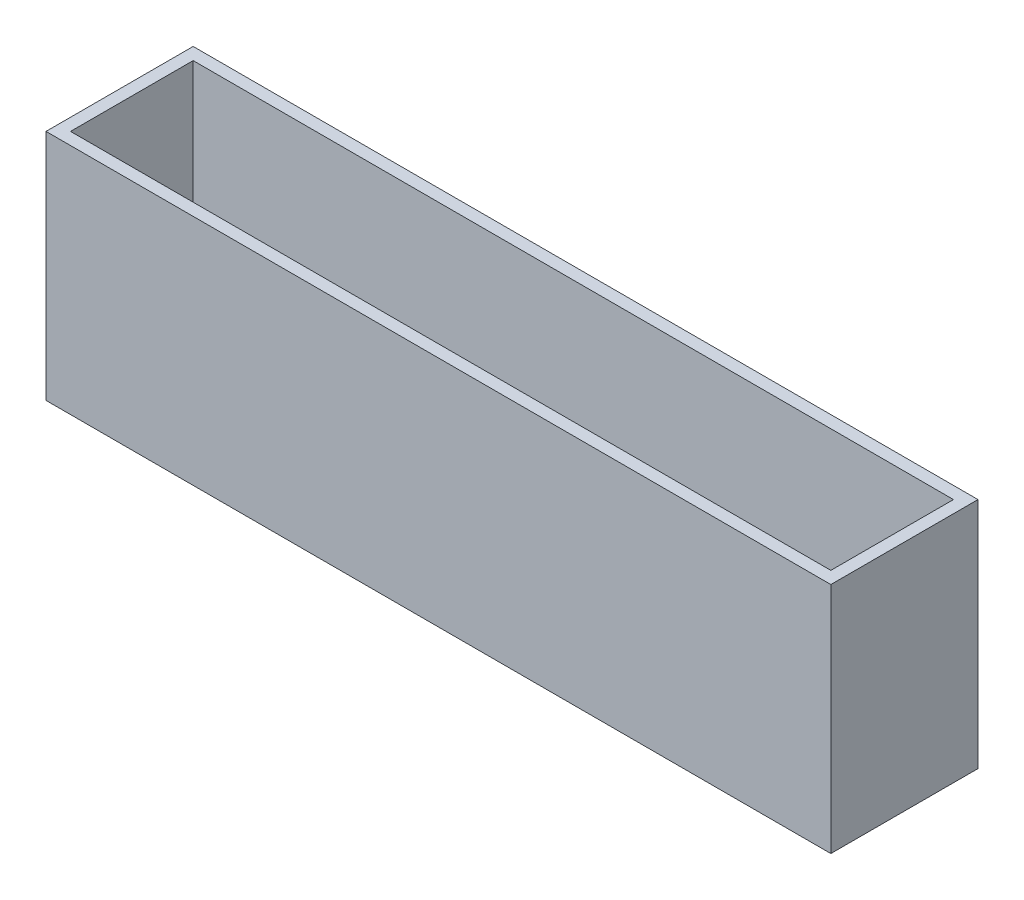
ISO-10303-21;
HEADER;
FILE_DESCRIPTION(('STEP AP214'),'2;1');
FILE_NAME('part.step','',(''),(''),'','','');
FILE_SCHEMA(('AUTOMOTIVE_DESIGN { 1 0 10303 214 1 1 1 1 }'));
ENDSEC;
DATA;
#1=APPLICATION_CONTEXT('core data for automotive mechanical design processes');
#2=APPLICATION_PROTOCOL_DEFINITION('international standard','automotive_design',2000,#1);
#3=PRODUCT_CONTEXT('',#1,'mechanical');
#4=PRODUCT('Part','Part','',(#3));
#5=PRODUCT_RELATED_PRODUCT_CATEGORY('part','',(#4));
#6=PRODUCT_DEFINITION_FORMATION('','',#4);
#7=PRODUCT_DEFINITION_CONTEXT('part definition',#1,'design');
#8=PRODUCT_DEFINITION('design','',#6,#7);
#9=PRODUCT_DEFINITION_SHAPE('','',#8);
#10=(LENGTH_UNIT() NAMED_UNIT(*) SI_UNIT(.MILLI.,.METRE.));
#11=(NAMED_UNIT(*) PLANE_ANGLE_UNIT() SI_UNIT($,.RADIAN.));
#12=(NAMED_UNIT(*) SI_UNIT($,.STERADIAN.) SOLID_ANGLE_UNIT());
#13=UNCERTAINTY_MEASURE_WITH_UNIT(LENGTH_MEASURE(1.E-05),#10,'distance_accuracy_value','');
#14=(GEOMETRIC_REPRESENTATION_CONTEXT(3) GLOBAL_UNCERTAINTY_ASSIGNED_CONTEXT((#13)) GLOBAL_UNIT_ASSIGNED_CONTEXT((#10,
#11,#12)) REPRESENTATION_CONTEXT('',''));
#15=CARTESIAN_POINT('',(0.,0.,0.));
#16=DIRECTION('',(0.,0.,1.));
#17=DIRECTION('',(1.,0.,0.));
#18=AXIS2_PLACEMENT_3D('',#15,#16,#17);
#19=CARTESIAN_POINT('',(-321.754973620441,12.7,0.));
#20=DIRECTION('',(0.,1.,0.));
#21=DIRECTION('',(0.,0.,1.));
#22=AXIS2_PLACEMENT_3D('',#19,#20,#21);
#23=PLANE('',#22);
#24=DIRECTION('',(-1.,0.,0.));
#25=VECTOR('',#24,1.);
#26=CARTESIAN_POINT('',(-321.754973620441,12.7,4.7625));
#27=LINE('',#26,#25);
#28=CARTESIAN_POINT('',(152.4,12.7,4.7625));
#29=VERTEX_POINT('',#28);
#30=CARTESIAN_POINT('',(-152.4,12.7,4.7625));
#31=VERTEX_POINT('',#30);
#32=EDGE_CURVE('E252',#29,#31,#27,.T.);
#33=ORIENTED_EDGE('',*,*,#32,.T.);
#34=CARTESIAN_POINT('',(-152.4,12.7,0.));
#35=DIRECTION('',(0.,1.,0.));
#36=DIRECTION('',(0.,0.,1.));
#37=AXIS2_PLACEMENT_3D('',#34,#35,#36);
#38=CIRCLE('',#37,4.76250000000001);
#39=CARTESIAN_POINT('',(-152.4,12.7,-4.76250000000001));
#40=VERTEX_POINT('',#39);
#41=EDGE_CURVE('E249',#40,#31,#38,.T.);
#42=ORIENTED_EDGE('',*,*,#41,.F.);
#43=DIRECTION('',(1.,0.,0.));
#44=VECTOR('',#43,1.);
#45=CARTESIAN_POINT('',(-321.754973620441,12.7,-4.76249999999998));
#46=LINE('',#45,#44);
#47=CARTESIAN_POINT('',(152.4,12.7,-4.76250000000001));
#48=VERTEX_POINT('',#47);
#49=EDGE_CURVE('E247',#40,#48,#46,.T.);
#50=ORIENTED_EDGE('',*,*,#49,.T.);
#51=CARTESIAN_POINT('',(152.4,12.7,0.));
#52=DIRECTION('',(0.,1.,0.));
#53=DIRECTION('',(0.,0.,1.));
#54=AXIS2_PLACEMENT_3D('',#51,#52,#53);
#55=CIRCLE('',#54,4.76250000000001);
#56=EDGE_CURVE('E237',#29,#48,#55,.T.);
#57=ORIENTED_EDGE('',*,*,#56,.F.);
#58=EDGE_LOOP('',(#33,#42,#50,#57));
#59=FACE_BOUND('',#58,.T.);
#60=DIRECTION('',(1.,0.,0.));
#61=VECTOR('',#60,1.);
#62=CARTESIAN_POINT('',(203.2,12.7,-31.75));
#63=LINE('',#62,#61);
#64=CARTESIAN_POINT('',(-196.85,12.7,-31.75));
#65=VERTEX_POINT('',#64);
#66=CARTESIAN_POINT('',(196.85,12.7,-31.75));
#67=VERTEX_POINT('',#66);
#68=EDGE_CURVE('E210',#65,#67,#63,.T.);
#69=ORIENTED_EDGE('',*,*,#68,.F.);
#70=DIRECTION('',(0.,0.,-1.));
#71=VECTOR('',#70,1.);
#72=CARTESIAN_POINT('',(-196.85,12.7,31.75));
#73=LINE('',#72,#71);
#74=CARTESIAN_POINT('',(-196.85,12.7,31.75));
#75=VERTEX_POINT('',#74);
#76=EDGE_CURVE('E190',#75,#65,#73,.T.);
#77=ORIENTED_EDGE('',*,*,#76,.F.);
#78=DIRECTION('',(1.,0.,0.));
#79=VECTOR('',#78,1.);
#80=CARTESIAN_POINT('',(203.2,12.7,31.75));
#81=LINE('',#80,#79);
#82=CARTESIAN_POINT('',(196.85,12.7,31.75));
#83=VERTEX_POINT('',#82);
#84=EDGE_CURVE('E218',#75,#83,#81,.T.);
#85=ORIENTED_EDGE('',*,*,#84,.T.);
#86=DIRECTION('',(0.,0.,-1.));
#87=VECTOR('',#86,1.);
#88=CARTESIAN_POINT('',(196.85,12.7,31.75));
#89=LINE('',#88,#87);
#90=EDGE_CURVE('E204',#83,#67,#89,.T.);
#91=ORIENTED_EDGE('',*,*,#90,.T.);
#92=EDGE_LOOP('',(#69,#77,#85,#91));
#93=FACE_BOUND('',#92,.T.);
#94=ADVANCED_FACE('F29',(#59,#93),#23,.T.);
#95=CARTESIAN_POINT('',(203.2,12.7,31.75));
#96=DIRECTION('',(0.,0.,-1.));
#97=DIRECTION('',(-1.,0.,0.));
#98=AXIS2_PLACEMENT_3D('',#95,#96,#97);
#99=PLANE('',#98);
#100=ORIENTED_EDGE('',*,*,#84,.F.);
#101=DIRECTION('',(0.,-1.,0.));
#102=VECTOR('',#101,1.);
#103=CARTESIAN_POINT('',(-196.85,120.65,31.75));
#104=LINE('',#103,#102);
#105=CARTESIAN_POINT('',(-196.85,120.65,31.75));
#106=VERTEX_POINT('',#105);
#107=EDGE_CURVE('E192',#106,#75,#104,.T.);
#108=ORIENTED_EDGE('',*,*,#107,.F.);
#109=DIRECTION('',(-1.,0.,0.));
#110=VECTOR('',#109,1.);
#111=CARTESIAN_POINT('',(203.2,120.65,31.75));
#112=LINE('',#111,#110);
#113=CARTESIAN_POINT('',(196.85,120.65,31.75));
#114=VERTEX_POINT('',#113);
#115=EDGE_CURVE('E221',#114,#106,#112,.T.);
#116=ORIENTED_EDGE('',*,*,#115,.F.);
#117=DIRECTION('',(0.,-1.,0.));
#118=VECTOR('',#117,1.);
#119=CARTESIAN_POINT('',(196.85,120.65,31.75));
#120=LINE('',#119,#118);
#121=EDGE_CURVE('E201',#114,#83,#120,.T.);
#122=ORIENTED_EDGE('',*,*,#121,.T.);
#123=EDGE_LOOP('',(#100,#108,#116,#122));
#124=FACE_BOUND('',#123,.T.);
#125=ADVANCED_FACE('F302',(#124),#99,.T.);
#126=CARTESIAN_POINT('',(203.2,12.7,-31.75));
#127=DIRECTION('',(0.,0.,1.));
#128=DIRECTION('',(-1.,0.,0.));
#129=AXIS2_PLACEMENT_3D('',#126,#127,#128);
#130=PLANE('',#129);
#131=DIRECTION('',(-1.,0.,0.));
#132=VECTOR('',#131,1.);
#133=CARTESIAN_POINT('',(203.2,120.65,-31.75));
#134=LINE('',#133,#132);
#135=CARTESIAN_POINT('',(196.85,120.65,-31.75));
#136=VERTEX_POINT('',#135);
#137=CARTESIAN_POINT('',(-196.85,120.65,-31.75));
#138=VERTEX_POINT('',#137);
#139=EDGE_CURVE('E212',#136,#138,#134,.T.);
#140=ORIENTED_EDGE('',*,*,#139,.T.);
#141=DIRECTION('',(0.,1.,0.));
#142=VECTOR('',#141,1.);
#143=CARTESIAN_POINT('',(-196.85,12.7,-31.75));
#144=LINE('',#143,#142);
#145=EDGE_CURVE('E187',#65,#138,#144,.T.);
#146=ORIENTED_EDGE('',*,*,#145,.F.);
#147=ORIENTED_EDGE('',*,*,#68,.T.);
#148=DIRECTION('',(0.,1.,0.));
#149=VECTOR('',#148,1.);
#150=CARTESIAN_POINT('',(196.85,12.7,-31.75));
#151=LINE('',#150,#149);
#152=EDGE_CURVE('E196',#67,#136,#151,.T.);
#153=ORIENTED_EDGE('',*,*,#152,.T.);
#154=EDGE_LOOP('',(#140,#146,#147,#153));
#155=FACE_BOUND('',#154,.T.);
#156=ADVANCED_FACE('F308',(#155),#130,.T.);
#157=CARTESIAN_POINT('',(-203.2,12.7,0.));
#158=DIRECTION('',(1.,0.,0.));
#159=DIRECTION('',(0.,0.,-1.));
#160=AXIS2_PLACEMENT_3D('',#157,#158,#159);
#161=PLANE('',#160);
#162=DIRECTION('',(0.,0.,1.));
#163=VECTOR('',#162,1.);
#164=CARTESIAN_POINT('',(-203.2,0.,0.));
#165=LINE('',#164,#163);
#166=CARTESIAN_POINT('',(-203.2,0.,-38.1));
#167=VERTEX_POINT('',#166);
#168=CARTESIAN_POINT('',(-203.2,0.,38.1));
#169=VERTEX_POINT('',#168);
#170=EDGE_CURVE('E262',#167,#169,#165,.T.);
#171=ORIENTED_EDGE('',*,*,#170,.T.);
#172=DIRECTION('',(0.,-1.,0.));
#173=VECTOR('',#172,1.);
#174=CARTESIAN_POINT('',(-203.2,12.7,38.1));
#175=LINE('',#174,#173);
#176=CARTESIAN_POINT('',(-203.2,120.65,38.1));
#177=VERTEX_POINT('',#176);
#178=EDGE_CURVE('E37',#177,#169,#175,.T.);
#179=ORIENTED_EDGE('',*,*,#178,.F.);
#180=DIRECTION('',(0.,0.,1.));
#181=VECTOR('',#180,1.);
#182=CARTESIAN_POINT('',(-203.2,120.65,31.75));
#183=LINE('',#182,#181);
#184=CARTESIAN_POINT('',(-203.2,120.65,-38.1));
#185=VERTEX_POINT('',#184);
#186=EDGE_CURVE('E265',#185,#177,#183,.T.);
#187=ORIENTED_EDGE('',*,*,#186,.F.);
#188=DIRECTION('',(0.,-1.,0.));
#189=VECTOR('',#188,1.);
#190=CARTESIAN_POINT('',(-203.2,12.7,-38.1));
#191=LINE('',#190,#189);
#192=EDGE_CURVE('E227',#185,#167,#191,.T.);
#193=ORIENTED_EDGE('',*,*,#192,.T.);
#194=EDGE_LOOP('',(#171,#179,#187,#193));
#195=FACE_BOUND('',#194,.T.);
#196=ADVANCED_FACE('F287',(#195),#161,.F.);
#197=CARTESIAN_POINT('',(-321.754973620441,12.7,38.1));
#198=DIRECTION('',(0.,0.,1.));
#199=DIRECTION('',(1.,0.,0.));
#200=AXIS2_PLACEMENT_3D('',#197,#198,#199);
#201=PLANE('',#200);
#202=DIRECTION('',(-1.,0.,0.));
#203=VECTOR('',#202,1.);
#204=CARTESIAN_POINT('',(-321.754973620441,0.,38.1));
#205=LINE('',#204,#203);
#206=CARTESIAN_POINT('',(203.2,0.,38.0999999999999));
#207=VERTEX_POINT('',#206);
#208=EDGE_CURVE('E259',#207,#169,#205,.T.);
#209=ORIENTED_EDGE('',*,*,#208,.F.);
#210=DIRECTION('',(0.,-1.,0.));
#211=VECTOR('',#210,1.);
#212=CARTESIAN_POINT('',(203.2,12.7,38.0999999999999));
#213=LINE('',#212,#211);
#214=CARTESIAN_POINT('',(203.2,120.65,38.1));
#215=VERTEX_POINT('',#214);
#216=EDGE_CURVE('E239',#215,#207,#213,.T.);
#217=ORIENTED_EDGE('',*,*,#216,.F.);
#218=DIRECTION('',(-1.,0.,0.));
#219=VECTOR('',#218,1.);
#220=CARTESIAN_POINT('',(203.2,120.65,38.1));
#221=LINE('',#220,#219);
#222=EDGE_CURVE('E215',#215,#177,#221,.T.);
#223=ORIENTED_EDGE('',*,*,#222,.T.);
#224=ORIENTED_EDGE('',*,*,#178,.T.);
#225=EDGE_LOOP('',(#209,#217,#223,#224));
#226=FACE_BOUND('',#225,.T.);
#227=ADVANCED_FACE('F278',(#226),#201,.T.);
#228=CARTESIAN_POINT('',(203.2,12.7,0.));
#229=DIRECTION('',(1.,0.,0.));
#230=DIRECTION('',(0.,0.,-1.));
#231=AXIS2_PLACEMENT_3D('',#228,#229,#230);
#232=PLANE('',#231);
#233=DIRECTION('',(0.,-1.,0.));
#234=VECTOR('',#233,1.);
#235=CARTESIAN_POINT('',(203.2,12.7,-38.1000000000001));
#236=LINE('',#235,#234);
#237=CARTESIAN_POINT('',(203.2,120.65,-38.1));
#238=VERTEX_POINT('',#237);
#239=CARTESIAN_POINT('',(203.2,0.,-38.1000000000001));
#240=VERTEX_POINT('',#239);
#241=EDGE_CURVE('E241',#238,#240,#236,.T.);
#242=ORIENTED_EDGE('',*,*,#241,.F.);
#243=DIRECTION('',(0.,0.,1.));
#244=VECTOR('',#243,1.);
#245=CARTESIAN_POINT('',(203.2,120.65,31.75));
#246=LINE('',#245,#244);
#247=EDGE_CURVE('E266',#238,#215,#246,.T.);
#248=ORIENTED_EDGE('',*,*,#247,.T.);
#249=ORIENTED_EDGE('',*,*,#216,.T.);
#250=DIRECTION('',(0.,0.,1.));
#251=VECTOR('',#250,1.);
#252=CARTESIAN_POINT('',(203.2,0.,0.));
#253=LINE('',#252,#251);
#254=EDGE_CURVE('E256',#240,#207,#253,.T.);
#255=ORIENTED_EDGE('',*,*,#254,.F.);
#256=EDGE_LOOP('',(#242,#248,#249,#255));
#257=FACE_BOUND('',#256,.T.);
#258=ADVANCED_FACE('F282',(#257),#232,.T.);
#259=CARTESIAN_POINT('',(-321.754973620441,12.7,4.7625));
#260=DIRECTION('',(0.,0.,1.));
#261=DIRECTION('',(1.,0.,0.));
#262=AXIS2_PLACEMENT_3D('',#259,#260,#261);
#263=PLANE('',#262);
#264=DIRECTION('',(0.,-1.,0.));
#265=VECTOR('',#264,1.);
#266=CARTESIAN_POINT('',(152.4,12.7,4.7625));
#267=LINE('',#266,#265);
#268=CARTESIAN_POINT('',(152.4,6.35,4.7625));
#269=VERTEX_POINT('',#268);
#270=EDGE_CURVE('E234',#29,#269,#267,.T.);
#271=ORIENTED_EDGE('',*,*,#270,.T.);
#272=DIRECTION('',(-1.,0.,0.));
#273=VECTOR('',#272,1.);
#274=CARTESIAN_POINT('',(-321.754973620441,6.35,4.7625));
#275=LINE('',#274,#273);
#276=CARTESIAN_POINT('',(-152.4,6.35,4.7625));
#277=VERTEX_POINT('',#276);
#278=EDGE_CURVE('E43',#269,#277,#275,.T.);
#279=ORIENTED_EDGE('',*,*,#278,.T.);
#280=DIRECTION('',(0.,-1.,0.));
#281=VECTOR('',#280,1.);
#282=CARTESIAN_POINT('',(-152.4,12.7,4.7625));
#283=LINE('',#282,#281);
#284=EDGE_CURVE('E224',#31,#277,#283,.T.);
#285=ORIENTED_EDGE('',*,*,#284,.F.);
#286=ORIENTED_EDGE('',*,*,#32,.F.);
#287=EDGE_LOOP('',(#271,#279,#285,#286));
#288=FACE_BOUND('',#287,.T.);
#289=ADVANCED_FACE('F31',(#288),#263,.F.);
#290=CARTESIAN_POINT('',(-152.4,12.7,0.));
#291=DIRECTION('',(0.,-1.,0.));
#292=DIRECTION('',(0.,0.,-1.));
#293=AXIS2_PLACEMENT_3D('',#290,#291,#292);
#294=CYLINDRICAL_SURFACE('',#293,4.76250000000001);
#295=CARTESIAN_POINT('',(-152.4,6.35,0.));
#296=DIRECTION('',(0.,1.,0.));
#297=DIRECTION('',(0.,0.,1.));
#298=AXIS2_PLACEMENT_3D('',#295,#296,#297);
#299=CIRCLE('',#298,4.76250000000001);
#300=CARTESIAN_POINT('',(-152.4,6.35,-4.76249999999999));
#301=VERTEX_POINT('',#300);
#302=EDGE_CURVE('E184',#301,#277,#299,.T.);
#303=ORIENTED_EDGE('',*,*,#302,.F.);
#304=DIRECTION('',(0.,-1.,0.));
#305=VECTOR('',#304,1.);
#306=CARTESIAN_POINT('',(-152.4,12.7,-4.76250000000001));
#307=LINE('',#306,#305);
#308=EDGE_CURVE('E228',#40,#301,#307,.T.);
#309=ORIENTED_EDGE('',*,*,#308,.F.);
#310=ORIENTED_EDGE('',*,*,#41,.T.);
#311=ORIENTED_EDGE('',*,*,#284,.T.);
#312=EDGE_LOOP('',(#303,#309,#310,#311));
#313=FACE_BOUND('',#312,.T.);
#314=ADVANCED_FACE('F323',(#313),#294,.F.);
#315=CARTESIAN_POINT('',(-321.754973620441,12.7,-4.76249999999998));
#316=DIRECTION('',(0.,0.,-1.));
#317=DIRECTION('',(-1.,0.,0.));
#318=AXIS2_PLACEMENT_3D('',#315,#316,#317);
#319=PLANE('',#318);
#320=ORIENTED_EDGE('',*,*,#308,.T.);
#321=DIRECTION('',(1.,0.,0.));
#322=VECTOR('',#321,1.);
#323=CARTESIAN_POINT('',(-321.754973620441,6.35,-4.76249999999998));
#324=LINE('',#323,#322);
#325=CARTESIAN_POINT('',(152.4,6.35,-4.76250000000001));
#326=VERTEX_POINT('',#325);
#327=EDGE_CURVE('E179',#301,#326,#324,.T.);
#328=ORIENTED_EDGE('',*,*,#327,.T.);
#329=DIRECTION('',(0.,-1.,0.));
#330=VECTOR('',#329,1.);
#331=CARTESIAN_POINT('',(152.4,12.7,-4.76250000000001));
#332=LINE('',#331,#330);
#333=EDGE_CURVE('E231',#48,#326,#332,.T.);
#334=ORIENTED_EDGE('',*,*,#333,.F.);
#335=ORIENTED_EDGE('',*,*,#49,.F.);
#336=EDGE_LOOP('',(#320,#328,#334,#335));
#337=FACE_BOUND('',#336,.T.);
#338=ADVANCED_FACE('F320',(#337),#319,.F.);
#339=CARTESIAN_POINT('',(152.4,12.7,0.));
#340=DIRECTION('',(0.,-1.,0.));
#341=DIRECTION('',(0.,0.,-1.));
#342=AXIS2_PLACEMENT_3D('',#339,#340,#341);
#343=CYLINDRICAL_SURFACE('',#342,4.76250000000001);
#344=CARTESIAN_POINT('',(152.4,6.35,0.));
#345=DIRECTION('',(0.,1.,0.));
#346=DIRECTION('',(0.,0.,1.));
#347=AXIS2_PLACEMENT_3D('',#344,#345,#346);
#348=CIRCLE('',#347,4.76250000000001);
#349=EDGE_CURVE('E11',#269,#326,#348,.T.);
#350=ORIENTED_EDGE('',*,*,#349,.F.);
#351=ORIENTED_EDGE('',*,*,#270,.F.);
#352=ORIENTED_EDGE('',*,*,#56,.T.);
#353=ORIENTED_EDGE('',*,*,#333,.T.);
#354=EDGE_LOOP('',(#350,#351,#352,#353));
#355=FACE_BOUND('',#354,.T.);
#356=ADVANCED_FACE('F298',(#355),#343,.F.);
#357=CARTESIAN_POINT('',(-321.754973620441,12.7,-38.1));
#358=DIRECTION('',(0.,0.,1.));
#359=DIRECTION('',(1.,0.,0.));
#360=AXIS2_PLACEMENT_3D('',#357,#358,#359);
#361=PLANE('',#360);
#362=DIRECTION('',(-1.,0.,0.));
#363=VECTOR('',#362,1.);
#364=CARTESIAN_POINT('',(-321.754973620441,0.,-38.1));
#365=LINE('',#364,#363);
#366=EDGE_CURVE('E254',#240,#167,#365,.T.);
#367=ORIENTED_EDGE('',*,*,#366,.T.);
#368=ORIENTED_EDGE('',*,*,#192,.F.);
#369=DIRECTION('',(-1.,0.,0.));
#370=VECTOR('',#369,1.);
#371=CARTESIAN_POINT('',(203.2,120.65,-38.1));
#372=LINE('',#371,#370);
#373=EDGE_CURVE('E207',#238,#185,#372,.T.);
#374=ORIENTED_EDGE('',*,*,#373,.F.);
#375=ORIENTED_EDGE('',*,*,#241,.T.);
#376=EDGE_LOOP('',(#367,#368,#374,#375));
#377=FACE_BOUND('',#376,.T.);
#378=ADVANCED_FACE('F285',(#377),#361,.F.);
#379=CARTESIAN_POINT('',(-321.754973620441,0.,0.));
#380=DIRECTION('',(0.,1.,0.));
#381=DIRECTION('',(0.,0.,1.));
#382=AXIS2_PLACEMENT_3D('',#379,#380,#381);
#383=PLANE('',#382);
#384=DIRECTION('',(-1.,0.,0.));
#385=VECTOR('',#384,1.);
#386=CARTESIAN_POINT('',(196.732319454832,0.,31.7473614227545));
#387=LINE('',#386,#385);
#388=CARTESIAN_POINT('',(196.732319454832,0.,31.7473614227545));
#389=VERTEX_POINT('',#388);
#390=CARTESIAN_POINT('',(-196.732319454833,0.,31.7473614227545));
#391=VERTEX_POINT('',#390);
#392=EDGE_CURVE('E156',#389,#391,#387,.T.);
#393=ORIENTED_EDGE('',*,*,#392,.F.);
#394=DIRECTION('',(0.,0.,1.));
#395=VECTOR('',#394,1.);
#396=CARTESIAN_POINT('',(196.732319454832,0.,31.7473614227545));
#397=LINE('',#396,#395);
#398=CARTESIAN_POINT('',(196.732319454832,0.,-31.7473614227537));
#399=VERTEX_POINT('',#398);
#400=EDGE_CURVE('E51',#399,#389,#397,.T.);
#401=ORIENTED_EDGE('',*,*,#400,.F.);
#402=DIRECTION('',(1.,0.,0.));
#403=VECTOR('',#402,1.);
#404=CARTESIAN_POINT('',(196.732319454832,0.,-31.7473614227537));
#405=LINE('',#404,#403);
#406=CARTESIAN_POINT('',(-196.732319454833,0.,-31.7473614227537));
#407=VERTEX_POINT('',#406);
#408=EDGE_CURVE('E163',#407,#399,#405,.T.);
#409=ORIENTED_EDGE('',*,*,#408,.F.);
#410=DIRECTION('',(0.,0.,-1.));
#411=VECTOR('',#410,1.);
#412=CARTESIAN_POINT('',(-196.732319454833,0.,31.7473614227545));
#413=LINE('',#412,#411);
#414=EDGE_CURVE('E145',#391,#407,#413,.T.);
#415=ORIENTED_EDGE('',*,*,#414,.F.);
#416=EDGE_LOOP('',(#393,#401,#409,#415));
#417=FACE_BOUND('',#416,.T.);
#418=ORIENTED_EDGE('',*,*,#170,.F.);
#419=ORIENTED_EDGE('',*,*,#366,.F.);
#420=ORIENTED_EDGE('',*,*,#254,.T.);
#421=ORIENTED_EDGE('',*,*,#208,.T.);
#422=EDGE_LOOP('',(#418,#419,#420,#421));
#423=FACE_BOUND('',#422,.T.);
#424=ADVANCED_FACE('F160',(#417,#423),#383,.F.);
#425=CARTESIAN_POINT('',(203.2,120.65,31.75));
#426=DIRECTION('',(0.,1.,0.));
#427=DIRECTION('',(-1.,0.,0.));
#428=AXIS2_PLACEMENT_3D('',#425,#426,#427);
#429=PLANE('',#428);
#430=ORIENTED_EDGE('',*,*,#373,.T.);
#431=ORIENTED_EDGE('',*,*,#186,.T.);
#432=ORIENTED_EDGE('',*,*,#222,.F.);
#433=ORIENTED_EDGE('',*,*,#247,.F.);
#434=EDGE_LOOP('',(#430,#431,#432,#433));
#435=FACE_BOUND('',#434,.T.);
#436=DIRECTION('',(0.,0.,1.));
#437=VECTOR('',#436,1.);
#438=CARTESIAN_POINT('',(-196.85,120.65,-31.75));
#439=LINE('',#438,#437);
#440=EDGE_CURVE('E194',#138,#106,#439,.T.);
#441=ORIENTED_EDGE('',*,*,#440,.F.);
#442=ORIENTED_EDGE('',*,*,#139,.F.);
#443=DIRECTION('',(0.,0.,1.));
#444=VECTOR('',#443,1.);
#445=CARTESIAN_POINT('',(196.85,120.65,-31.75));
#446=LINE('',#445,#444);
#447=EDGE_CURVE('E198',#136,#114,#446,.T.);
#448=ORIENTED_EDGE('',*,*,#447,.T.);
#449=ORIENTED_EDGE('',*,*,#115,.T.);
#450=EDGE_LOOP('',(#441,#442,#448,#449));
#451=FACE_BOUND('',#450,.T.);
#452=ADVANCED_FACE('F271',(#435,#451),#429,.T.);
#453=CARTESIAN_POINT('',(196.85,120.65,-31.75));
#454=DIRECTION('',(1.,0.,0.));
#455=DIRECTION('',(0.,0.,-1.));
#456=AXIS2_PLACEMENT_3D('',#453,#454,#455);
#457=PLANE('',#456);
#458=ORIENTED_EDGE('',*,*,#152,.F.);
#459=ORIENTED_EDGE('',*,*,#90,.F.);
#460=ORIENTED_EDGE('',*,*,#121,.F.);
#461=ORIENTED_EDGE('',*,*,#447,.F.);
#462=EDGE_LOOP('',(#458,#459,#460,#461));
#463=FACE_BOUND('',#462,.T.);
#464=ADVANCED_FACE('F295',(#463),#457,.F.);
#465=CARTESIAN_POINT('',(-196.85,120.65,-31.75));
#466=DIRECTION('',(-1.,0.,0.));
#467=DIRECTION('',(0.,0.,-1.));
#468=AXIS2_PLACEMENT_3D('',#465,#466,#467);
#469=PLANE('',#468);
#470=ORIENTED_EDGE('',*,*,#145,.T.);
#471=ORIENTED_EDGE('',*,*,#440,.T.);
#472=ORIENTED_EDGE('',*,*,#107,.T.);
#473=ORIENTED_EDGE('',*,*,#76,.T.);
#474=EDGE_LOOP('',(#470,#471,#472,#473));
#475=FACE_BOUND('',#474,.T.);
#476=ADVANCED_FACE('F340',(#475),#469,.F.);
#477=CARTESIAN_POINT('',(196.732319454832,6.35,-31.7473614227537));
#478=DIRECTION('',(0.,1.,0.));
#479=DIRECTION('',(0.,0.,1.));
#480=AXIS2_PLACEMENT_3D('',#477,#478,#479);
#481=PLANE('',#480);
#482=DIRECTION('',(0.,0.,1.));
#483=VECTOR('',#482,1.);
#484=CARTESIAN_POINT('',(196.732319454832,6.35,31.7473614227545));
#485=LINE('',#484,#483);
#486=CARTESIAN_POINT('',(196.732319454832,6.35,-31.7473614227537));
#487=VERTEX_POINT('',#486);
#488=CARTESIAN_POINT('',(196.732319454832,6.35,31.7473614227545));
#489=VERTEX_POINT('',#488);
#490=EDGE_CURVE('E165',#487,#489,#485,.T.);
#491=ORIENTED_EDGE('',*,*,#490,.T.);
#492=DIRECTION('',(-1.,0.,0.));
#493=VECTOR('',#492,1.);
#494=CARTESIAN_POINT('',(196.732319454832,6.35,31.7473614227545));
#495=LINE('',#494,#493);
#496=CARTESIAN_POINT('',(-196.732319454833,6.35,31.7473614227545));
#497=VERTEX_POINT('',#496);
#498=EDGE_CURVE('E171',#489,#497,#495,.T.);
#499=ORIENTED_EDGE('',*,*,#498,.T.);
#500=DIRECTION('',(0.,0.,-1.));
#501=VECTOR('',#500,1.);
#502=CARTESIAN_POINT('',(-196.732319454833,6.35,31.7473614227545));
#503=LINE('',#502,#501);
#504=CARTESIAN_POINT('',(-196.732319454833,6.35,-31.7473614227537));
#505=VERTEX_POINT('',#504);
#506=EDGE_CURVE('E148',#497,#505,#503,.T.);
#507=ORIENTED_EDGE('',*,*,#506,.T.);
#508=DIRECTION('',(1.,0.,0.));
#509=VECTOR('',#508,1.);
#510=CARTESIAN_POINT('',(196.732319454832,6.35,-31.7473614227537));
#511=LINE('',#510,#509);
#512=EDGE_CURVE('E174',#505,#487,#511,.T.);
#513=ORIENTED_EDGE('',*,*,#512,.T.);
#514=EDGE_LOOP('',(#491,#499,#507,#513));
#515=FACE_BOUND('',#514,.T.);
#516=ORIENTED_EDGE('',*,*,#349,.T.);
#517=ORIENTED_EDGE('',*,*,#327,.F.);
#518=ORIENTED_EDGE('',*,*,#302,.T.);
#519=ORIENTED_EDGE('',*,*,#278,.F.);
#520=EDGE_LOOP('',(#516,#517,#518,#519));
#521=FACE_BOUND('',#520,.T.);
#522=ADVANCED_FACE('F338',(#515,#521),#481,.F.);
#523=CARTESIAN_POINT('',(196.732319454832,6.35,31.7473614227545));
#524=DIRECTION('',(1.,0.,0.));
#525=DIRECTION('',(0.,0.,-1.));
#526=AXIS2_PLACEMENT_3D('',#523,#524,#525);
#527=PLANE('',#526);
#528=ORIENTED_EDGE('',*,*,#400,.T.);
#529=DIRECTION('',(0.,-1.,0.));
#530=VECTOR('',#529,1.);
#531=CARTESIAN_POINT('',(196.732319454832,6.35,31.7473614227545));
#532=LINE('',#531,#530);
#533=EDGE_CURVE('E153',#489,#389,#532,.T.);
#534=ORIENTED_EDGE('',*,*,#533,.F.);
#535=ORIENTED_EDGE('',*,*,#490,.F.);
#536=DIRECTION('',(0.,-1.,0.));
#537=VECTOR('',#536,1.);
#538=CARTESIAN_POINT('',(196.732319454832,6.35,-31.7473614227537));
#539=LINE('',#538,#537);
#540=EDGE_CURVE('E177',#487,#399,#539,.T.);
#541=ORIENTED_EDGE('',*,*,#540,.T.);
#542=EDGE_LOOP('',(#528,#534,#535,#541));
#543=FACE_BOUND('',#542,.T.);
#544=ADVANCED_FACE('F339',(#543),#527,.F.);
#545=CARTESIAN_POINT('',(196.732319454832,6.35,-31.7473614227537));
#546=DIRECTION('',(0.,0.,-1.));
#547=DIRECTION('',(-1.,0.,0.));
#548=AXIS2_PLACEMENT_3D('',#545,#546,#547);
#549=PLANE('',#548);
#550=ORIENTED_EDGE('',*,*,#408,.T.);
#551=ORIENTED_EDGE('',*,*,#540,.F.);
#552=ORIENTED_EDGE('',*,*,#512,.F.);
#553=DIRECTION('',(0.,-1.,0.));
#554=VECTOR('',#553,1.);
#555=CARTESIAN_POINT('',(-196.732319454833,6.35,-31.7473614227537));
#556=LINE('',#555,#554);
#557=EDGE_CURVE('E152',#505,#407,#556,.T.);
#558=ORIENTED_EDGE('',*,*,#557,.T.);
#559=EDGE_LOOP('',(#550,#551,#552,#558));
#560=FACE_BOUND('',#559,.T.);
#561=ADVANCED_FACE('F346',(#560),#549,.F.);
#562=CARTESIAN_POINT('',(-196.732319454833,6.35,31.7473614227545));
#563=DIRECTION('',(-1.,0.,0.));
#564=DIRECTION('',(0.,0.,1.));
#565=AXIS2_PLACEMENT_3D('',#562,#563,#564);
#566=PLANE('',#565);
#567=ORIENTED_EDGE('',*,*,#414,.T.);
#568=ORIENTED_EDGE('',*,*,#557,.F.);
#569=ORIENTED_EDGE('',*,*,#506,.F.);
#570=DIRECTION('',(0.,-1.,0.));
#571=VECTOR('',#570,1.);
#572=CARTESIAN_POINT('',(-196.732319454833,6.35,31.7473614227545));
#573=LINE('',#572,#571);
#574=EDGE_CURVE('E141',#497,#391,#573,.T.);
#575=ORIENTED_EDGE('',*,*,#574,.T.);
#576=EDGE_LOOP('',(#567,#568,#569,#575));
#577=FACE_BOUND('',#576,.T.);
#578=ADVANCED_FACE('F143',(#577),#566,.F.);
#579=CARTESIAN_POINT('',(196.732319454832,6.35,31.7473614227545));
#580=DIRECTION('',(0.,0.,1.));
#581=DIRECTION('',(1.,0.,0.));
#582=AXIS2_PLACEMENT_3D('',#579,#580,#581);
#583=PLANE('',#582);
#584=ORIENTED_EDGE('',*,*,#392,.T.);
#585=ORIENTED_EDGE('',*,*,#574,.F.);
#586=ORIENTED_EDGE('',*,*,#498,.F.);
#587=ORIENTED_EDGE('',*,*,#533,.T.);
#588=EDGE_LOOP('',(#584,#585,#586,#587));
#589=FACE_BOUND('',#588,.T.);
#590=ADVANCED_FACE('F157',(#589),#583,.F.);
#591=CLOSED_SHELL('',(#94,#125,#156,#196,#227,#258,#289,#314,#338,#356,#378,#424,#452,#464,#476,
#522,#544,#561,#578,#590));
#592=MANIFOLD_SOLID_BREP('B2',#591);
#593=ADVANCED_BREP_SHAPE_REPRESENTATION('',(#18,#592),#14);
#594=SHAPE_DEFINITION_REPRESENTATION(#9,#593);
ENDSEC;
END-ISO-10303-21;
